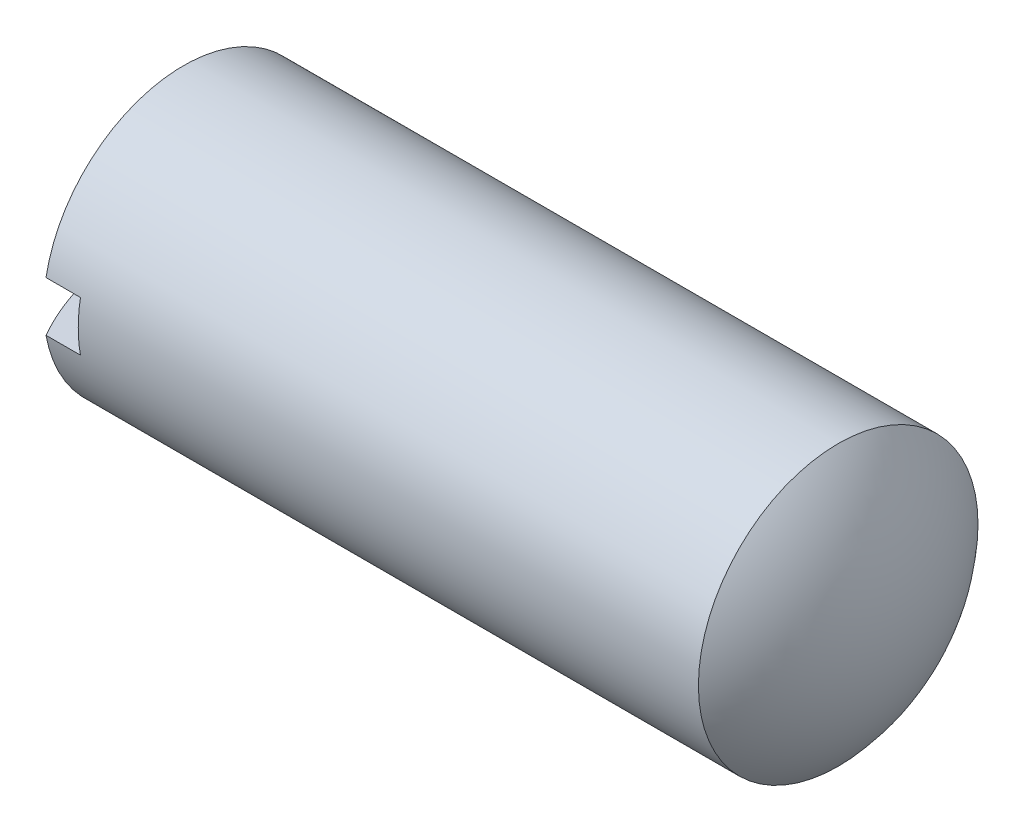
from build123d import *

# Parameters (mm, degrees)
SKETCH2_W  = 19.05
SKETCH2_H  = 3.4036
SLOT_DEPTH = 4.9022


with BuildPart() as part:
    # BodySke → BaseBody (revolve)
    with BuildSketch(Plane.XY):
        with BuildLine():
            Line((2.552216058, 9.525), (47.157428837, 9.525))
            ThreePointArc((47.157428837, 9.525), (49.8582952, 5.098871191), (50.8, 0))
            Line((50.8, 0), (0, 0))
            ThreePointArc((0, 0), (0.649113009, 4.930502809), (2.552216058, 9.525))
        make_face()
    revolve(axis=Axis((-12.7, 0, 0), (1, 0, 0)))

    # Sketch2 → Slot (cut)
    with BuildSketch(Plane(origin=(0, 0, 0), x_dir=(0, 0, -1), z_dir=(1, 0, 0))):
        Rectangle(SKETCH2_W, SKETCH2_H)
    extrude(amount=SLOT_DEPTH, mode=Mode.SUBTRACT)


solid = part.part
